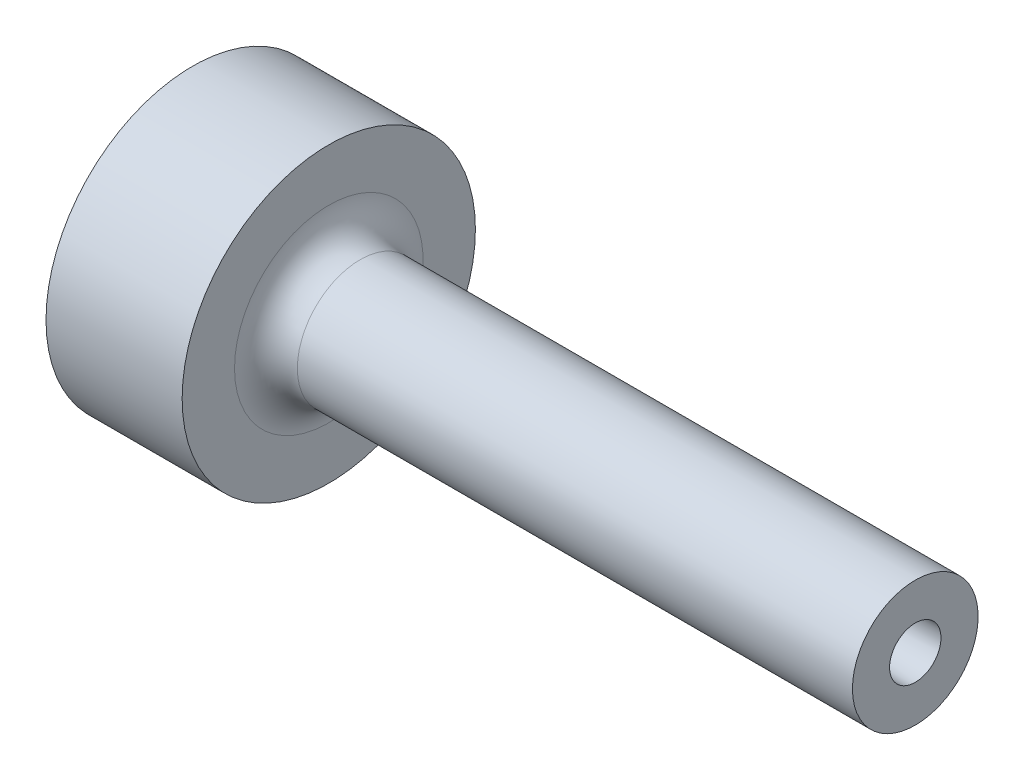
ISO-10303-21;
HEADER;
FILE_DESCRIPTION(('STEP AP214'),'2;1');
FILE_NAME('part.step','',(''),(''),'','','');
FILE_SCHEMA(('AUTOMOTIVE_DESIGN { 1 0 10303 214 1 1 1 1 }'));
ENDSEC;
DATA;
#1=APPLICATION_CONTEXT('core data for automotive mechanical design processes');
#2=APPLICATION_PROTOCOL_DEFINITION('international standard','automotive_design',2000,#1);
#3=PRODUCT_CONTEXT('',#1,'mechanical');
#4=PRODUCT('Part','Part','',(#3));
#5=PRODUCT_RELATED_PRODUCT_CATEGORY('part','',(#4));
#6=PRODUCT_DEFINITION_FORMATION('','',#4);
#7=PRODUCT_DEFINITION_CONTEXT('part definition',#1,'design');
#8=PRODUCT_DEFINITION('design','',#6,#7);
#9=PRODUCT_DEFINITION_SHAPE('','',#8);
#10=(LENGTH_UNIT() NAMED_UNIT(*) SI_UNIT(.MILLI.,.METRE.));
#11=(NAMED_UNIT(*) PLANE_ANGLE_UNIT() SI_UNIT($,.RADIAN.));
#12=(NAMED_UNIT(*) SI_UNIT($,.STERADIAN.) SOLID_ANGLE_UNIT());
#13=UNCERTAINTY_MEASURE_WITH_UNIT(LENGTH_MEASURE(1.E-05),#10,'distance_accuracy_value','');
#14=(GEOMETRIC_REPRESENTATION_CONTEXT(3) GLOBAL_UNCERTAINTY_ASSIGNED_CONTEXT((#13)) GLOBAL_UNIT_ASSIGNED_CONTEXT((#10,
#11,#12)) REPRESENTATION_CONTEXT('',''));
#15=CARTESIAN_POINT('',(0.,0.,0.));
#16=DIRECTION('',(0.,0.,1.));
#17=DIRECTION('',(1.,0.,0.));
#18=AXIS2_PLACEMENT_3D('',#15,#16,#17);
#19=CARTESIAN_POINT('',(0.,0.,0.));
#20=DIRECTION('',(-1.,0.,0.));
#21=DIRECTION('',(0.,0.,1.));
#22=AXIS2_PLACEMENT_3D('',#19,#20,#21);
#23=CYLINDRICAL_SURFACE('',#22,14.);
#24=CARTESIAN_POINT('',(13.,0.,0.));
#25=DIRECTION('',(-1.,0.,0.));
#26=DIRECTION('',(0.,0.,1.));
#27=AXIS2_PLACEMENT_3D('',#24,#25,#26);
#28=CIRCLE('',#27,14.);
#29=CARTESIAN_POINT('',(13.,0.,14.));
#30=VERTEX_POINT('',#29);
#31=EDGE_CURVE('E88',#30,#30,#28,.T.);
#32=ORIENTED_EDGE('',*,*,#31,.T.);
#33=EDGE_LOOP('',(#32));
#34=FACE_BOUND('',#33,.T.);
#35=CARTESIAN_POINT('',(0.,0.,0.));
#36=DIRECTION('',(-1.,0.,0.));
#37=DIRECTION('',(0.,0.,1.));
#38=AXIS2_PLACEMENT_3D('',#35,#36,#37);
#39=CIRCLE('',#38,14.);
#40=CARTESIAN_POINT('',(0.,0.,14.));
#41=VERTEX_POINT('',#40);
#42=EDGE_CURVE('E83',#41,#41,#39,.T.);
#43=ORIENTED_EDGE('',*,*,#42,.F.);
#44=EDGE_LOOP('',(#43));
#45=FACE_BOUND('',#44,.T.);
#46=CARTESIAN_POINT('',(6.5,-13.856406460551,-2.));
#47=CARTESIAN_POINT('',(6.61172417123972,-13.8564082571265,-1.99999534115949));
#48=CARTESIAN_POINT('',(6.72351471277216,-13.8577723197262,-1.99060664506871));
#49=CARTESIAN_POINT('',(6.9439746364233,-13.8630779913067,-1.95330740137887));
#50=CARTESIAN_POINT('',(7.05264079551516,-13.8670221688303,-1.92537839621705));
#51=CARTESIAN_POINT('',(7.26362870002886,-13.8770324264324,-1.85184738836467));
#52=CARTESIAN_POINT('',(7.36595507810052,-13.8830969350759,-1.80625847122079));
#53=CARTESIAN_POINT('',(7.56148972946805,-13.8966626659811,-1.69873175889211));
#54=CARTESIAN_POINT('',(7.65469934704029,-13.9041636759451,-1.63679637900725));
#55=CARTESIAN_POINT('',(7.83004829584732,-13.9198182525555,-1.49785346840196));
#56=CARTESIAN_POINT('',(7.91211171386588,-13.9279757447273,-1.42075056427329));
#57=CARTESIAN_POINT('',(8.06218155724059,-13.9439890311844,-1.25386707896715));
#58=CARTESIAN_POINT('',(8.13018723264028,-13.9518448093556,-1.16408582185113));
#59=CARTESIAN_POINT('',(8.25048909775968,-13.9664103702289,-0.973910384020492));
#60=CARTESIAN_POINT('',(8.30271571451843,-13.9731150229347,-0.873471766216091));
#61=CARTESIAN_POINT('',(8.38953073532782,-13.9845795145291,-0.665136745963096));
#62=CARTESIAN_POINT('',(8.4241199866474,-13.9893394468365,-0.557240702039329));
#63=CARTESIAN_POINT('',(8.47444920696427,-13.9963505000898,-0.337834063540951));
#64=CARTESIAN_POINT('',(8.49031606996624,-13.9986185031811,-0.226353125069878));
#65=CARTESIAN_POINT('',(8.5031438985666,-14.0004479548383,-0.00228956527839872));
#66=CARTESIAN_POINT('',(8.50010582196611,-14.0000095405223,0.110292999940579));
#67=CARTESIAN_POINT('',(8.47531062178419,-13.9964890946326,0.33249899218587));
#68=CARTESIAN_POINT('',(8.45369000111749,-13.9934263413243,0.442137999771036));
#69=CARTESIAN_POINT('',(8.39255744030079,-13.9850228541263,0.656215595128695));
#70=CARTESIAN_POINT('',(8.3530450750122,-13.9796820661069,0.760654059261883));
#71=CARTESIAN_POINT('',(8.25710925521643,-13.9672894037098,0.961781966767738));
#72=CARTESIAN_POINT('',(8.20062784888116,-13.9602316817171,1.05844339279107));
#73=CARTESIAN_POINT('',(8.07239950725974,-13.9451926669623,1.24096782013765));
#74=CARTESIAN_POINT('',(8.00065165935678,-13.9372113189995,1.32683017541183));
#75=CARTESIAN_POINT('',(7.843165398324,-13.921132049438,1.48612299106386));
#76=CARTESIAN_POINT('',(7.75730786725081,-13.9130337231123,1.55943569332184));
#77=CARTESIAN_POINT('',(7.57444547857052,-13.8977029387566,1.69062989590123));
#78=CARTESIAN_POINT('',(7.47744056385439,-13.890470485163,1.74851131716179));
#79=CARTESIAN_POINT('',(7.27491971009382,-13.8776905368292,1.84721301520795));
#80=CARTESIAN_POINT('',(7.1693981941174,-13.8721441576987,1.88802200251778));
#81=CARTESIAN_POINT('',(6.95290242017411,-13.8633846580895,1.9513062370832));
#82=CARTESIAN_POINT('',(6.84192850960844,-13.8601713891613,1.97378265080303));
#83=CARTESIAN_POINT('',(6.61872346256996,-13.8564698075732,1.99960390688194));
#84=CARTESIAN_POINT('',(6.50651197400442,-13.8559577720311,2.00311531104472));
#85=CARTESIAN_POINT('',(6.28310219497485,-13.8576537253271,1.9913480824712));
#86=CARTESIAN_POINT('',(6.17190387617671,-13.8598616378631,1.9760699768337));
#87=CARTESIAN_POINT('',(5.95418781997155,-13.8667269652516,1.92729837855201));
#88=CARTESIAN_POINT('',(5.84765127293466,-13.8713733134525,1.8938871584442));
#89=CARTESIAN_POINT('',(5.6416912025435,-13.8825829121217,1.80988306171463));
#90=CARTESIAN_POINT('',(5.54226800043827,-13.8891462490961,1.75928940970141));
#91=CARTESIAN_POINT('',(5.35260812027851,-13.9035064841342,1.64195360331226));
#92=CARTESIAN_POINT('',(5.26243903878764,-13.911311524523,1.57510320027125));
#93=CARTESIAN_POINT('',(5.09454027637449,-13.9272509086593,1.42730277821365));
#94=CARTESIAN_POINT('',(5.01681123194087,-13.9353852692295,1.34635203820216));
#95=CARTESIAN_POINT('',(4.8754047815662,-13.9511405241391,1.17191708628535));
#96=CARTESIAN_POINT('',(4.81183747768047,-13.9587570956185,1.07834317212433));
#97=CARTESIAN_POINT('',(4.70132443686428,-13.972552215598,0.881748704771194));
#98=CARTESIAN_POINT('',(4.65437828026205,-13.9787308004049,0.778728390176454));
#99=CARTESIAN_POINT('',(4.57861788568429,-13.9889347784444,0.566515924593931));
#100=CARTESIAN_POINT('',(4.54974241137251,-13.9929674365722,0.457345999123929));
#101=CARTESIAN_POINT('',(4.51074453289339,-13.9984555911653,0.235645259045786));
#102=CARTESIAN_POINT('',(4.50062101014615,-13.9999112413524,0.123114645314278));
#103=CARTESIAN_POINT('',(4.49943976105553,-14.0000800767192,-0.101043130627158));
#104=CARTESIAN_POINT('',(4.50821318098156,-13.998817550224,-0.212669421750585));
#105=CARTESIAN_POINT('',(4.54421615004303,-13.9937406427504,-0.432842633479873));
#106=CARTESIAN_POINT('',(4.57144565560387,-13.989926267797,-0.541389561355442));
#107=CARTESIAN_POINT('',(4.6435299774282,-13.9801722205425,-0.752283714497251));
#108=CARTESIAN_POINT('',(4.68837418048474,-13.9742338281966,-0.854634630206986));
#109=CARTESIAN_POINT('',(4.79439714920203,-13.960885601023,-1.05038570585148));
#110=CARTESIAN_POINT('',(4.8555763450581,-13.9534757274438,-1.14378562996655));
#111=CARTESIAN_POINT('',(4.99314771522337,-13.9379304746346,-1.31984194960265));
#112=CARTESIAN_POINT('',(5.06966490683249,-13.9297894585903,-1.40240016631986));
#113=CARTESIAN_POINT('',(5.2354775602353,-13.9137422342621,-1.55356716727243));
#114=CARTESIAN_POINT('',(5.32477602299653,-13.9058360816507,-1.6221726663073));
#115=CARTESIAN_POINT('',(5.51414543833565,-13.8911108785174,-1.74379523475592));
#116=CARTESIAN_POINT('',(5.61426869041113,-13.8842975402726,-1.79673154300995));
#117=CARTESIAN_POINT('',(5.82203229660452,-13.8725962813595,-1.88495902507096));
#118=CARTESIAN_POINT('',(5.92966459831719,-13.8677063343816,-1.92026877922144));
#119=CARTESIAN_POINT('',(6.11483642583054,-13.8615529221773,-1.96409255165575));
#120=CARTESIAN_POINT('',(6.19122433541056,-13.859633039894,-1.97753762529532));
#121=CARTESIAN_POINT('',(6.34506419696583,-13.857059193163,-1.99549291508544));
#122=CARTESIAN_POINT('',(6.42251613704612,-13.8564052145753,-2.00000323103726));
#123=CARTESIAN_POINT('',(6.5,-13.856406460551,-2.));
#124=B_SPLINE_CURVE_WITH_KNOTS('',3,(#46,#47,#48,#49,#50,#51,#52,#53,#54,#55,#56,#57,#58,#59,
#60,#61,#62,#63,#64,#65,#66,#67,#68,#69,#70,#71,#72,#73,#74,#75,#76,#77,#78,#79,#80,#81,#82,#83,
#84,#85,#86,#87,#88,#89,#90,#91,#92,#93,#94,#95,#96,#97,#98,#99,#100,#101,#102,#103,#104,#105,
#106,#107,#108,#109,#110,#111,#112,#113,#114,#115,#116,#117,#118,#119,#120,#121,#122,#123),
.UNSPECIFIED.,.T.,.F.,(4,2,2,2,2,2,2,2,2,2,2,2,2,2,2,2,2,2,2,2,2,2,2,2,2,2,2,2,2,2,2,2,2,2,2,2,
2,2,4),(0.,0.334889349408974,0.670112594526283,1.00508792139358,1.34001378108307,
1.6771171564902,2.01423851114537,2.35282530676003,2.6913958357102,3.02765822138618,
3.36390357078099,3.69769984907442,4.03150405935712,4.36646147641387,4.70143892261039,
5.03940517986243,5.37737316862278,5.7155642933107,6.05373389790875,6.3889286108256,
6.72411392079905,7.05779100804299,7.39148315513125,7.72746121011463,8.06345644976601,
8.40197921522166,8.74049343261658,9.07785422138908,9.41519488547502,9.74953375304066,
10.083871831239,10.4180087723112,10.7521545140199,11.0891434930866,11.426211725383,
11.7649881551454,12.103406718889,12.3356645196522,12.5679197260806),.UNSPECIFIED.);
#125=CARTESIAN_POINT('',(6.5,-13.856406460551,-2.));
#126=VERTEX_POINT('',#125);
#127=EDGE_CURVE('E9',#126,#126,#124,.T.);
#128=ORIENTED_EDGE('',*,*,#127,.F.);
#129=EDGE_LOOP('',(#128));
#130=FACE_BOUND('',#129,.T.);
#131=ADVANCED_FACE('F15',(#34,#45,#130),#23,.T.);
#132=CARTESIAN_POINT('',(0.,0.,0.));
#133=DIRECTION('',(1.,0.,0.));
#134=DIRECTION('',(0.,0.,-1.));
#135=AXIS2_PLACEMENT_3D('',#132,#133,#134);
#136=CONICAL_SURFACE('',#135,1.25,0.0174532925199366);
#137=CARTESIAN_POINT('',(69.,0.,0.));
#138=DIRECTION('',(-1.,0.,0.));
#139=DIRECTION('',(0.,0.,1.));
#140=AXIS2_PLACEMENT_3D('',#137,#138,#139);
#141=CIRCLE('',#140,2.45439948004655);
#142=CARTESIAN_POINT('',(69.,0.,2.45439948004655));
#143=VERTEX_POINT('',#142);
#144=EDGE_CURVE('E80',#143,#143,#141,.T.);
#145=ORIENTED_EDGE('',*,*,#144,.F.);
#146=EDGE_LOOP('',(#145));
#147=FACE_BOUND('',#146,.T.);
#148=CARTESIAN_POINT('',(1.22738614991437,0.,0.));
#149=DIRECTION('',(-1.,0.,0.));
#150=DIRECTION('',(0.,0.,1.));
#151=AXIS2_PLACEMENT_3D('',#148,#149,#150);
#152=CIRCLE('',#151,1.27142410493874);
#153=CARTESIAN_POINT('',(1.22738614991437,0.,1.27142410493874));
#154=VERTEX_POINT('',#153);
#155=EDGE_CURVE('E93',#154,#154,#152,.F.);
#156=ORIENTED_EDGE('',*,*,#155,.F.);
#157=EDGE_LOOP('',(#156));
#158=FACE_BOUND('',#157,.T.);
#159=ADVANCED_FACE('F44',(#147,#158),#136,.F.);
#160=CARTESIAN_POINT('',(16.,0.,0.));
#161=DIRECTION('',(-1.,0.,0.));
#162=DIRECTION('',(0.,0.,1.));
#163=AXIS2_PLACEMENT_3D('',#160,#161,#162);
#164=TOROIDAL_SURFACE('',#163,9.,3.);
#165=CARTESIAN_POINT('',(13.,0.,0.));
#166=DIRECTION('',(-1.,0.,0.));
#167=DIRECTION('',(0.,0.,1.));
#168=AXIS2_PLACEMENT_3D('',#165,#166,#167);
#169=CIRCLE('',#168,9.);
#170=CARTESIAN_POINT('',(13.,0.,9.));
#171=VERTEX_POINT('',#170);
#172=EDGE_CURVE('E90',#171,#171,#169,.T.);
#173=ORIENTED_EDGE('',*,*,#172,.F.);
#174=EDGE_LOOP('',(#173));
#175=FACE_BOUND('',#174,.T.);
#176=CARTESIAN_POINT('',(16.,0.,0.));
#177=DIRECTION('',(-1.,0.,0.));
#178=DIRECTION('',(0.,0.,1.));
#179=AXIS2_PLACEMENT_3D('',#176,#177,#178);
#180=CIRCLE('',#179,6.);
#181=CARTESIAN_POINT('',(16.,0.,6.));
#182=VERTEX_POINT('',#181);
#183=EDGE_CURVE('E27',#182,#182,#180,.T.);
#184=ORIENTED_EDGE('',*,*,#183,.T.);
#185=EDGE_LOOP('',(#184));
#186=FACE_BOUND('',#185,.T.);
#187=ADVANCED_FACE('F17',(#175,#186),#164,.F.);
#188=CARTESIAN_POINT('',(0.,0.,0.));
#189=DIRECTION('',(-1.,0.,0.));
#190=DIRECTION('',(0.,0.,1.));
#191=AXIS2_PLACEMENT_3D('',#188,#189,#190);
#192=CYLINDRICAL_SURFACE('',#191,6.);
#193=ORIENTED_EDGE('',*,*,#183,.F.);
#194=EDGE_LOOP('',(#193));
#195=FACE_BOUND('',#194,.T.);
#196=CARTESIAN_POINT('',(69.,0.,0.));
#197=DIRECTION('',(-1.,0.,0.));
#198=DIRECTION('',(0.,0.,1.));
#199=AXIS2_PLACEMENT_3D('',#196,#197,#198);
#200=CIRCLE('',#199,6.);
#201=CARTESIAN_POINT('',(69.,0.,6.));
#202=VERTEX_POINT('',#201);
#203=EDGE_CURVE('E79',#202,#202,#200,.T.);
#204=ORIENTED_EDGE('',*,*,#203,.T.);
#205=EDGE_LOOP('',(#204));
#206=FACE_BOUND('',#205,.T.);
#207=ADVANCED_FACE('F65',(#195,#206),#192,.T.);
#208=CARTESIAN_POINT('',(69.,6.,0.));
#209=DIRECTION('',(-1.,0.,0.));
#210=DIRECTION('',(0.,0.,1.));
#211=AXIS2_PLACEMENT_3D('',#208,#209,#210);
#212=PLANE('',#211);
#213=ORIENTED_EDGE('',*,*,#203,.F.);
#214=EDGE_LOOP('',(#213));
#215=FACE_BOUND('',#214,.T.);
#216=ORIENTED_EDGE('',*,*,#144,.T.);
#217=EDGE_LOOP('',(#216));
#218=FACE_BOUND('',#217,.T.);
#219=ADVANCED_FACE('F61',(#215,#218),#212,.F.);
#220=CARTESIAN_POINT('',(0.,1.25,0.));
#221=DIRECTION('',(1.,0.,0.));
#222=DIRECTION('',(0.,0.,-1.));
#223=AXIS2_PLACEMENT_3D('',#220,#221,#222);
#224=PLANE('',#223);
#225=CARTESIAN_POINT('',(0.,0.,0.));
#226=DIRECTION('',(-1.,0.,0.));
#227=DIRECTION('',(0.,0.,1.));
#228=AXIS2_PLACEMENT_3D('',#225,#226,#227);
#229=CIRCLE('',#228,5.);
#230=CARTESIAN_POINT('',(0.,0.,5.));
#231=VERTEX_POINT('',#230);
#232=EDGE_CURVE('E96',#231,#231,#229,.T.);
#233=ORIENTED_EDGE('',*,*,#232,.F.);
#234=EDGE_LOOP('',(#233));
#235=FACE_BOUND('',#234,.T.);
#236=ORIENTED_EDGE('',*,*,#42,.T.);
#237=EDGE_LOOP('',(#236));
#238=FACE_BOUND('',#237,.T.);
#239=ADVANCED_FACE('F59',(#235,#238),#224,.F.);
#240=CARTESIAN_POINT('',(13.,14.,0.));
#241=DIRECTION('',(-1.,0.,0.));
#242=DIRECTION('',(0.,0.,1.));
#243=AXIS2_PLACEMENT_3D('',#240,#241,#242);
#244=PLANE('',#243);
#245=ORIENTED_EDGE('',*,*,#31,.F.);
#246=EDGE_LOOP('',(#245));
#247=FACE_BOUND('',#246,.T.);
#248=ORIENTED_EDGE('',*,*,#172,.T.);
#249=EDGE_LOOP('',(#248));
#250=FACE_BOUND('',#249,.T.);
#251=ADVANCED_FACE('F57',(#247,#250),#244,.F.);
#252=CARTESIAN_POINT('',(-37.3349076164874,0.,0.));
#253=DIRECTION('',(-1.,0.,0.));
#254=DIRECTION('',(0.,0.,1.));
#255=AXIS2_PLACEMENT_3D('',#252,#253,#254);
#256=DEGENERATE_TOROIDAL_SURFACE('',#255,9.35634609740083,40.,.F.);
#257=ORIENTED_EDGE('',*,*,#232,.T.);
#258=EDGE_LOOP('',(#257));
#259=FACE_BOUND('',#258,.T.);
#260=ORIENTED_EDGE('',*,*,#155,.T.);
#261=EDGE_LOOP('',(#260));
#262=FACE_BOUND('',#261,.T.);
#263=ADVANCED_FACE('F40',(#259,#262),#256,.T.);
#264=CARTESIAN_POINT('',(6.5,-14.,0.));
#265=DIRECTION('',(0.,-1.,0.));
#266=DIRECTION('',(0.,0.,-1.));
#267=AXIS2_PLACEMENT_3D('',#264,#265,#266);
#268=CYLINDRICAL_SURFACE('',#267,2.);
#269=CARTESIAN_POINT('',(6.5,-8.,0.));
#270=DIRECTION('',(0.,-1.,0.));
#271=DIRECTION('',(0.,0.,-1.));
#272=AXIS2_PLACEMENT_3D('',#269,#270,#271);
#273=CIRCLE('',#272,2.);
#274=CARTESIAN_POINT('',(6.5,-8.,-2.));
#275=VERTEX_POINT('',#274);
#276=EDGE_CURVE('E99',#275,#275,#273,.T.);
#277=ORIENTED_EDGE('',*,*,#276,.F.);
#278=EDGE_LOOP('',(#277));
#279=FACE_BOUND('',#278,.T.);
#280=ORIENTED_EDGE('',*,*,#127,.T.);
#281=EDGE_LOOP('',(#280));
#282=FACE_BOUND('',#281,.T.);
#283=ADVANCED_FACE('F32',(#279,#282),#268,.F.);
#284=CARTESIAN_POINT('',(6.5,-6.84529946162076,0.));
#285=DIRECTION('',(0.,-1.,0.));
#286=DIRECTION('',(0.,0.,-1.));
#287=AXIS2_PLACEMENT_3D('',#284,#285,#286);
#288=CONICAL_SURFACE('',#287,0.,1.0471975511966);
#289=ORIENTED_EDGE('',*,*,#276,.T.);
#290=EDGE_LOOP('',(#289));
#291=FACE_BOUND('',#290,.T.);
#292=CARTESIAN_POINT('',(6.5,-6.84529946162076,0.));
#293=VERTEX_POINT('',#292);
#294=VERTEX_LOOP('',#293);
#295=FACE_BOUND('',#294,.T.);
#296=ADVANCED_FACE('F30',(#291,#295),#288,.F.);
#297=CLOSED_SHELL('',(#131,#159,#187,#207,#219,#239,#251,#263,#283,#296));
#298=MANIFOLD_SOLID_BREP('B1',#297);
#299=ADVANCED_BREP_SHAPE_REPRESENTATION('',(#18,#298),#14);
#300=SHAPE_DEFINITION_REPRESENTATION(#9,#299);
ENDSEC;
END-ISO-10303-21;
